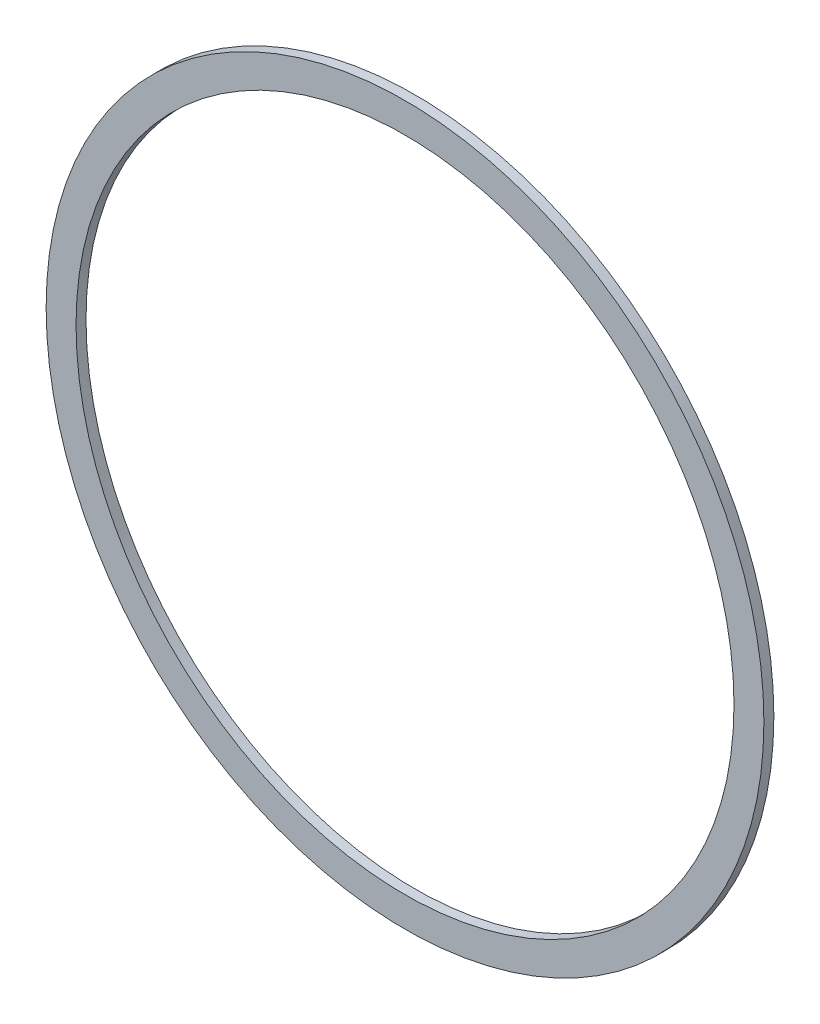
ISO-10303-21;
HEADER;
FILE_DESCRIPTION(('STEP AP214'),'2;1');
FILE_NAME('part.step','',(''),(''),'','','');
FILE_SCHEMA(('AUTOMOTIVE_DESIGN { 1 0 10303 214 1 1 1 1 }'));
ENDSEC;
DATA;
#1=APPLICATION_CONTEXT('core data for automotive mechanical design processes');
#2=APPLICATION_PROTOCOL_DEFINITION('international standard','automotive_design',2000,#1);
#3=PRODUCT_CONTEXT('',#1,'mechanical');
#4=PRODUCT('Part','Part','',(#3));
#5=PRODUCT_RELATED_PRODUCT_CATEGORY('part','',(#4));
#6=PRODUCT_DEFINITION_FORMATION('','',#4);
#7=PRODUCT_DEFINITION_CONTEXT('part definition',#1,'design');
#8=PRODUCT_DEFINITION('design','',#6,#7);
#9=PRODUCT_DEFINITION_SHAPE('','',#8);
#10=(LENGTH_UNIT() NAMED_UNIT(*) SI_UNIT(.MILLI.,.METRE.));
#11=(NAMED_UNIT(*) PLANE_ANGLE_UNIT() SI_UNIT($,.RADIAN.));
#12=(NAMED_UNIT(*) SI_UNIT($,.STERADIAN.) SOLID_ANGLE_UNIT());
#13=UNCERTAINTY_MEASURE_WITH_UNIT(LENGTH_MEASURE(1.E-05),#10,'distance_accuracy_value','');
#14=(GEOMETRIC_REPRESENTATION_CONTEXT(3) GLOBAL_UNCERTAINTY_ASSIGNED_CONTEXT((#13)) GLOBAL_UNIT_ASSIGNED_CONTEXT((#10,
#11,#12)) REPRESENTATION_CONTEXT('',''));
#15=CARTESIAN_POINT('',(0.,0.,0.));
#16=DIRECTION('',(0.,0.,1.));
#17=DIRECTION('',(1.,0.,0.));
#18=AXIS2_PLACEMENT_3D('',#15,#16,#17);
#19=CARTESIAN_POINT('',(0.,0.,1.));
#20=DIRECTION('',(0.,0.,1.));
#21=DIRECTION('',(1.,0.,0.));
#22=AXIS2_PLACEMENT_3D('',#19,#20,#21);
#23=PLANE('',#22);
#24=CARTESIAN_POINT('',(0.,0.,1.));
#25=DIRECTION('',(0.,0.,1.));
#26=DIRECTION('',(1.,0.,0.));
#27=AXIS2_PLACEMENT_3D('',#24,#25,#26);
#28=CIRCLE('',#27,36.);
#29=CARTESIAN_POINT('',(36.,0.,1.));
#30=VERTEX_POINT('',#29);
#31=EDGE_CURVE('E10',#30,#30,#28,.T.);
#32=ORIENTED_EDGE('',*,*,#31,.T.);
#33=EDGE_LOOP('',(#32));
#34=FACE_BOUND('',#33,.T.);
#35=CARTESIAN_POINT('',(0.,0.,1.));
#36=DIRECTION('',(0.,0.,1.));
#37=DIRECTION('',(1.,0.,0.));
#38=AXIS2_PLACEMENT_3D('',#35,#36,#37);
#39=CIRCLE('',#38,33.);
#40=CARTESIAN_POINT('',(33.,0.,1.));
#41=VERTEX_POINT('',#40);
#42=EDGE_CURVE('E43',#41,#41,#39,.T.);
#43=ORIENTED_EDGE('',*,*,#42,.F.);
#44=EDGE_LOOP('',(#43));
#45=FACE_BOUND('',#44,.T.);
#46=ADVANCED_FACE('F32',(#34,#45),#23,.T.);
#47=CARTESIAN_POINT('',(0.,0.,0.));
#48=DIRECTION('',(0.,0.,1.));
#49=DIRECTION('',(1.,0.,0.));
#50=AXIS2_PLACEMENT_3D('',#47,#48,#49);
#51=PLANE('',#50);
#52=CARTESIAN_POINT('',(0.,0.,0.));
#53=DIRECTION('',(0.,0.,1.));
#54=DIRECTION('',(1.,0.,0.));
#55=AXIS2_PLACEMENT_3D('',#52,#53,#54);
#56=CIRCLE('',#55,36.);
#57=CARTESIAN_POINT('',(36.,0.,0.));
#58=VERTEX_POINT('',#57);
#59=EDGE_CURVE('E36',#58,#58,#56,.T.);
#60=ORIENTED_EDGE('',*,*,#59,.F.);
#61=EDGE_LOOP('',(#60));
#62=FACE_BOUND('',#61,.T.);
#63=CARTESIAN_POINT('',(0.,0.,0.));
#64=DIRECTION('',(0.,0.,1.));
#65=DIRECTION('',(1.,0.,0.));
#66=AXIS2_PLACEMENT_3D('',#63,#64,#65);
#67=CIRCLE('',#66,33.);
#68=CARTESIAN_POINT('',(33.,0.,0.));
#69=VERTEX_POINT('',#68);
#70=EDGE_CURVE('E45',#69,#69,#67,.T.);
#71=ORIENTED_EDGE('',*,*,#70,.T.);
#72=EDGE_LOOP('',(#71));
#73=FACE_BOUND('',#72,.T.);
#74=ADVANCED_FACE('F55',(#62,#73),#51,.F.);
#75=CARTESIAN_POINT('',(0.,0.,1.));
#76=DIRECTION('',(0.,0.,-1.));
#77=DIRECTION('',(-1.,0.,0.));
#78=AXIS2_PLACEMENT_3D('',#75,#76,#77);
#79=CYLINDRICAL_SURFACE('',#78,36.);
#80=ORIENTED_EDGE('',*,*,#31,.F.);
#81=EDGE_LOOP('',(#80));
#82=FACE_BOUND('',#81,.T.);
#83=ORIENTED_EDGE('',*,*,#59,.T.);
#84=EDGE_LOOP('',(#83));
#85=FACE_BOUND('',#84,.T.);
#86=ADVANCED_FACE('F34',(#82,#85),#79,.T.);
#87=CARTESIAN_POINT('',(0.,0.,1.));
#88=DIRECTION('',(0.,0.,-1.));
#89=DIRECTION('',(-1.,0.,0.));
#90=AXIS2_PLACEMENT_3D('',#87,#88,#89);
#91=CYLINDRICAL_SURFACE('',#90,33.);
#92=ORIENTED_EDGE('',*,*,#42,.T.);
#93=EDGE_LOOP('',(#92));
#94=FACE_BOUND('',#93,.T.);
#95=ORIENTED_EDGE('',*,*,#70,.F.);
#96=EDGE_LOOP('',(#95));
#97=FACE_BOUND('',#96,.T.);
#98=ADVANCED_FACE('F51',(#94,#97),#91,.F.);
#99=CLOSED_SHELL('',(#46,#74,#86,#98));
#100=MANIFOLD_SOLID_BREP('B2',#99);
#101=ADVANCED_BREP_SHAPE_REPRESENTATION('',(#18,#100),#14);
#102=SHAPE_DEFINITION_REPRESENTATION(#9,#101);
ENDSEC;
END-ISO-10303-21;
